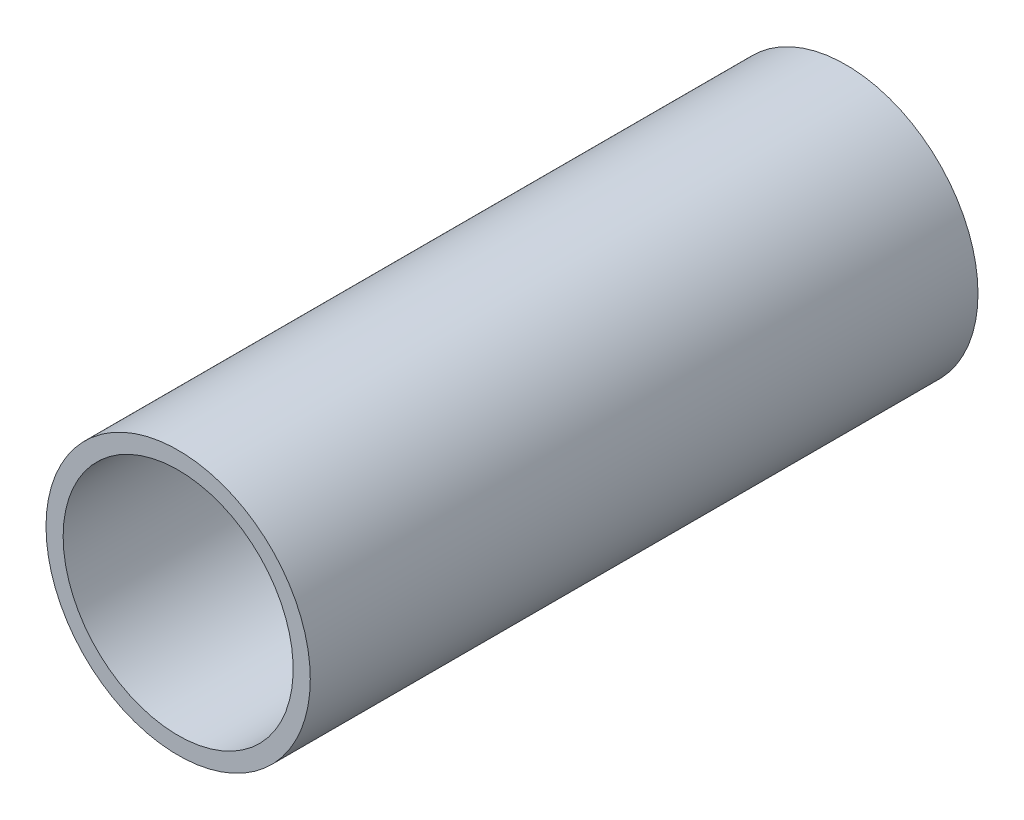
from build123d import *

# Parameters (mm, degrees)
SKETCH1_R           = 30.1625
SKETCH1_R_2         = 26.2509
EXTRUDE_THIN1_DEPTH = 76.2


with BuildPart() as part:
    # Sketch1 → Extrude-Thin1 (new, symmetric)
    with BuildSketch(Plane.XY):
        Circle(SKETCH1_R)
        Circle(SKETCH1_R_2, mode=Mode.SUBTRACT)
    extrude(amount=EXTRUDE_THIN1_DEPTH, both=True)


solid = part.part
